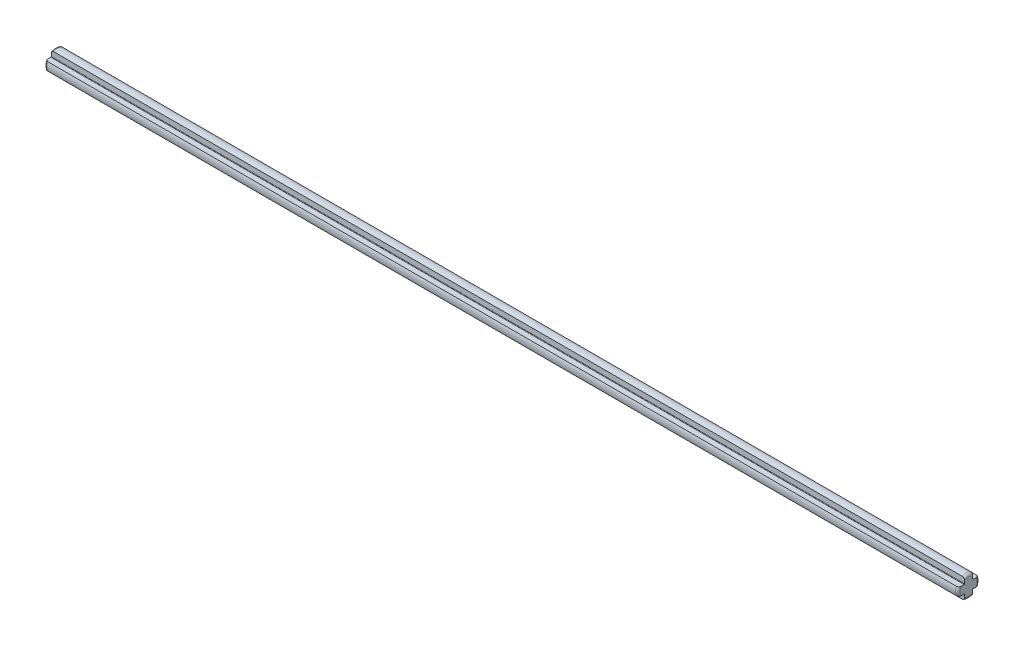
ISO-10303-21;
HEADER;
FILE_DESCRIPTION(('STEP AP214'),'2;1');
FILE_NAME('part.step','',(''),(''),'','','');
FILE_SCHEMA(('AUTOMOTIVE_DESIGN { 1 0 10303 214 1 1 1 1 }'));
ENDSEC;
DATA;
#1=APPLICATION_CONTEXT('core data for automotive mechanical design processes');
#2=APPLICATION_PROTOCOL_DEFINITION('international standard','automotive_design',2000,#1);
#3=PRODUCT_CONTEXT('',#1,'mechanical');
#4=PRODUCT('Part','Part','',(#3));
#5=PRODUCT_RELATED_PRODUCT_CATEGORY('part','',(#4));
#6=PRODUCT_DEFINITION_FORMATION('','',#4);
#7=PRODUCT_DEFINITION_CONTEXT('part definition',#1,'design');
#8=PRODUCT_DEFINITION('design','',#6,#7);
#9=PRODUCT_DEFINITION_SHAPE('','',#8);
#10=(LENGTH_UNIT() NAMED_UNIT(*) SI_UNIT(.MILLI.,.METRE.));
#11=(NAMED_UNIT(*) PLANE_ANGLE_UNIT() SI_UNIT($,.RADIAN.));
#12=(NAMED_UNIT(*) SI_UNIT($,.STERADIAN.) SOLID_ANGLE_UNIT());
#13=UNCERTAINTY_MEASURE_WITH_UNIT(LENGTH_MEASURE(1.E-05),#10,'distance_accuracy_value','');
#14=(GEOMETRIC_REPRESENTATION_CONTEXT(3) GLOBAL_UNCERTAINTY_ASSIGNED_CONTEXT((#13)) GLOBAL_UNIT_ASSIGNED_CONTEXT((#10,
#11,#12)) REPRESENTATION_CONTEXT('',''));
#15=CARTESIAN_POINT('',(0.,0.,0.));
#16=DIRECTION('',(0.,0.,1.));
#17=DIRECTION('',(1.,0.,0.));
#18=AXIS2_PLACEMENT_3D('',#15,#16,#17);
#19=CARTESIAN_POINT('',(100.,0.,0.));
#20=DIRECTION('',(-1.,0.,0.));
#21=DIRECTION('',(0.,0.,1.));
#22=AXIS2_PLACEMENT_3D('',#19,#20,#21);
#23=CYLINDRICAL_SURFACE('',#22,2.35);
#24=DIRECTION('',(-1.,0.,0.));
#25=VECTOR('',#24,1.);
#26=CARTESIAN_POINT('',(100.,0.9,2.17082933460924));
#27=LINE('',#26,#25);
#28=CARTESIAN_POINT('',(99.5,0.9,2.17082933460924));
#29=VERTEX_POINT('',#28);
#30=CARTESIAN_POINT('',(-99.5,0.9,2.17082933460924));
#31=VERTEX_POINT('',#30);
#32=EDGE_CURVE('E246',#29,#31,#27,.T.);
#33=ORIENTED_EDGE('',*,*,#32,.T.);
#34=CARTESIAN_POINT('',(-99.5,0.,0.));
#35=DIRECTION('',(1.,0.,0.));
#36=DIRECTION('',(0.,0.,-1.));
#37=AXIS2_PLACEMENT_3D('',#34,#35,#36);
#38=CIRCLE('',#37,2.35);
#39=CARTESIAN_POINT('',(-99.5,-0.900000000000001,2.17082933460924));
#40=VERTEX_POINT('',#39);
#41=EDGE_CURVE('E511',#31,#40,#38,.T.);
#42=ORIENTED_EDGE('',*,*,#41,.T.);
#43=DIRECTION('',(-1.,0.,0.));
#44=VECTOR('',#43,1.);
#45=CARTESIAN_POINT('',(100.,-0.900000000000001,2.17082933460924));
#46=LINE('',#45,#44);
#47=CARTESIAN_POINT('',(99.5,-0.900000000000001,2.17082933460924));
#48=VERTEX_POINT('',#47);
#49=EDGE_CURVE('E217',#48,#40,#46,.T.);
#50=ORIENTED_EDGE('',*,*,#49,.F.);
#51=CARTESIAN_POINT('',(99.5,0.,0.));
#52=DIRECTION('',(1.,0.,0.));
#53=DIRECTION('',(0.,0.,-1.));
#54=AXIS2_PLACEMENT_3D('',#51,#52,#53);
#55=CIRCLE('',#54,2.35);
#56=EDGE_CURVE('E366',#48,#29,#55,.F.);
#57=ORIENTED_EDGE('',*,*,#56,.T.);
#58=EDGE_LOOP('',(#33,#42,#50,#57));
#59=FACE_BOUND('',#58,.T.);
#60=ADVANCED_FACE('F33',(#59),#23,.T.);
#61=CARTESIAN_POINT('',(100.,-0.900000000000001,2.17082933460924));
#62=DIRECTION('',(0.,1.,0.));
#63=DIRECTION('',(0.,0.,1.));
#64=AXIS2_PLACEMENT_3D('',#61,#62,#63);
#65=PLANE('',#64);
#66=ORIENTED_EDGE('',*,*,#49,.T.);
#67=CARTESIAN_POINT('',(-99.5,-0.900000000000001,2.17082933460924));
#68=CARTESIAN_POINT('',(-99.5264833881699,-0.900000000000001,2.17085986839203));
#69=CARTESIAN_POINT('',(-99.5529498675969,-0.900000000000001,2.16855372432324));
#70=CARTESIAN_POINT('',(-99.6050453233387,-0.900000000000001,2.15950506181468));
#71=CARTESIAN_POINT('',(-99.6306762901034,-0.900000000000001,2.15277404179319));
#72=CARTESIAN_POINT('',(-99.6804387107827,-0.900000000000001,2.1351114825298));
#73=CARTESIAN_POINT('',(-99.7045703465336,-0.900000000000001,2.12418045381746));
#74=CARTESIAN_POINT('',(-99.7507251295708,-0.900000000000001,2.09852306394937));
#75=CARTESIAN_POINT('',(-99.7727475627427,-0.900000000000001,2.0837954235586));
#76=CARTESIAN_POINT('',(-99.8147234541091,-0.900000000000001,2.05060839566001));
#77=CARTESIAN_POINT('',(-99.8346070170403,-0.900000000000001,2.03206082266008));
#78=CARTESIAN_POINT('',(-99.8712243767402,-0.900000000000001,1.99209288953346));
#79=CARTESIAN_POINT('',(-99.8879579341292,-0.900000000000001,1.97067231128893));
#80=CARTESIAN_POINT('',(-99.9190973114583,-0.900000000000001,1.92396602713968));
#81=CARTESIAN_POINT('',(-99.9332527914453,-0.900000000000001,1.89851375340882));
#82=CARTESIAN_POINT('',(-99.9575247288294,-0.900000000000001,1.84573102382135));
#83=CARTESIAN_POINT('',(-99.9676367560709,-0.900000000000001,1.81839854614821));
#84=CARTESIAN_POINT('',(-99.9838866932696,-0.900000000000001,1.76219756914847));
#85=CARTESIAN_POINT('',(-99.9899702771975,-0.900000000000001,1.73331353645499));
#86=CARTESIAN_POINT('',(-99.9980270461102,-0.900000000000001,1.67505065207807));
#87=CARTESIAN_POINT('',(-100.000010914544,-0.900000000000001,1.64567328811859));
#88=CARTESIAN_POINT('',(-100.,-0.900000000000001,1.61632298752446));
#89=B_SPLINE_CURVE_WITH_KNOTS('',3,(#67,#68,#69,#70,#71,#72,#73,#74,#75,#76,#77,#78,#79,#80,#81,
#82,#83,#84,#85,#86,#87,#88),.UNSPECIFIED.,.F.,.F.,(4,2,2,2,2,2,2,2,2,2,4),(0.,
0.079323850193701,0.158442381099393,0.237551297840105,0.316686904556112,0.397909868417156,
0.479139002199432,0.566147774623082,0.653251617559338,0.741507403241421,0.829532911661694),.UNSPECIFIED.);
#90=CARTESIAN_POINT('',(-100.,-0.900000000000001,1.61632298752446));
#91=VERTEX_POINT('',#90);
#92=EDGE_CURVE('E386',#40,#91,#89,.T.);
#93=ORIENTED_EDGE('',*,*,#92,.T.);
#94=DIRECTION('',(0.,0.,-1.));
#95=VECTOR('',#94,1.);
#96=CARTESIAN_POINT('',(-100.,-0.900000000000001,2.17082933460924));
#97=LINE('',#96,#95);
#98=CARTESIAN_POINT('',(-100.,-0.900000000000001,0.999999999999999));
#99=VERTEX_POINT('',#98);
#100=EDGE_CURVE('E214',#91,#99,#97,.T.);
#101=ORIENTED_EDGE('',*,*,#100,.T.);
#102=DIRECTION('',(-1.,0.,0.));
#103=VECTOR('',#102,1.);
#104=CARTESIAN_POINT('',(100.,-0.900000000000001,0.999999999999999));
#105=LINE('',#104,#103);
#106=CARTESIAN_POINT('',(100.,-0.900000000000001,0.999999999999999));
#107=VERTEX_POINT('',#106);
#108=EDGE_CURVE('E210',#107,#99,#105,.T.);
#109=ORIENTED_EDGE('',*,*,#108,.F.);
#110=DIRECTION('',(0.,0.,-1.));
#111=VECTOR('',#110,1.);
#112=CARTESIAN_POINT('',(100.,-0.900000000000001,2.17082933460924));
#113=LINE('',#112,#111);
#114=CARTESIAN_POINT('',(100.,-0.900000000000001,1.61632298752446));
#115=VERTEX_POINT('',#114);
#116=EDGE_CURVE('E197',#115,#107,#113,.T.);
#117=ORIENTED_EDGE('',*,*,#116,.F.);
#118=CARTESIAN_POINT('',(100.,-0.900000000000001,1.61632298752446));
#119=CARTESIAN_POINT('',(100.000022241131,-0.900000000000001,1.65066661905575));
#120=CARTESIAN_POINT('',(99.9972983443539,-0.900000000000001,1.68506058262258));
#121=CARTESIAN_POINT('',(99.9862156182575,-0.900000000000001,1.75308687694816));
#122=CARTESIAN_POINT('',(99.9778303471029,-0.900000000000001,1.78671486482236));
#123=CARTESIAN_POINT('',(99.9552419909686,-0.900000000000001,1.85211366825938));
#124=CARTESIAN_POINT('',(99.9410195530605,-0.900000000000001,1.88387790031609));
#125=CARTESIAN_POINT('',(99.9069131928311,-0.900000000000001,1.94414749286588));
#126=CARTESIAN_POINT('',(99.8870416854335,-0.900000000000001,1.97265980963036));
#127=CARTESIAN_POINT('',(99.8442224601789,-0.900000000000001,2.02268935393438));
#128=CARTESIAN_POINT('',(99.8217526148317,-0.900000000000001,2.04461521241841));
#129=CARTESIAN_POINT('',(99.7730890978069,-0.900000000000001,2.08389547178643));
#130=CARTESIAN_POINT('',(99.7468952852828,-0.900000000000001,2.10124969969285));
#131=CARTESIAN_POINT('',(99.6943438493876,-0.900000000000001,2.12912089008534));
#132=CARTESIAN_POINT('',(99.6682509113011,-0.900000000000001,2.14013932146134));
#133=CARTESIAN_POINT('',(99.6145341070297,-0.900000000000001,2.15730052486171));
#134=CARTESIAN_POINT('',(99.586913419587,-0.900000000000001,2.1634530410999));
#135=CARTESIAN_POINT('',(99.5492135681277,-0.900000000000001,2.16830749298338));
#136=CARTESIAN_POINT('',(99.5393866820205,-0.900000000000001,2.1692533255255));
#137=CARTESIAN_POINT('',(99.5197081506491,-0.900000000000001,2.17051341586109));
#138=CARTESIAN_POINT('',(99.5098565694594,-0.900000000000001,2.17082867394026));
#139=CARTESIAN_POINT('',(99.5,-0.900000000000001,2.17082933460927));
#140=B_SPLINE_CURVE_WITH_KNOTS('',3,(#118,#119,#120,#121,#122,#123,#124,#125,#126,#127,#128,
#129,#130,#131,#132,#133,#134,#135,#136,#137,#138,#139),.UNSPECIFIED.,.F.,.F.,(4,2,2,2,2,2,2,2,
2,2,4),(0.,0.10300027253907,0.206484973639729,0.310315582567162,0.413919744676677,
0.507586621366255,0.601257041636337,0.68579977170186,0.770172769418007,0.799774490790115,
0.829329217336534),.UNSPECIFIED.);
#141=EDGE_CURVE('E516',#115,#48,#140,.T.);
#142=ORIENTED_EDGE('',*,*,#141,.T.);
#143=EDGE_LOOP('',(#66,#93,#101,#109,#117,#142));
#144=FACE_BOUND('',#143,.T.);
#145=ADVANCED_FACE('F212',(#144),#65,.F.);
#146=CARTESIAN_POINT('',(100.,-1.,0.999999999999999));
#147=DIRECTION('',(-1.,0.,0.));
#148=DIRECTION('',(0.,0.,1.));
#149=AXIS2_PLACEMENT_3D('',#146,#147,#148);
#150=CYLINDRICAL_SURFACE('',#149,0.0999999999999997);
#151=CARTESIAN_POINT('',(-100.,-1.,0.999999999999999));
#152=DIRECTION('',(-1.,0.,0.));
#153=DIRECTION('',(0.,0.,1.));
#154=AXIS2_PLACEMENT_3D('',#151,#152,#153);
#155=CIRCLE('',#154,0.0999999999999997);
#156=CARTESIAN_POINT('',(-100.,-1.,0.899999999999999));
#157=VERTEX_POINT('',#156);
#158=EDGE_CURVE('E248',#99,#157,#155,.T.);
#159=ORIENTED_EDGE('',*,*,#158,.T.);
#160=DIRECTION('',(-1.,0.,0.));
#161=VECTOR('',#160,1.);
#162=CARTESIAN_POINT('',(100.,-1.,0.899999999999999));
#163=LINE('',#162,#161);
#164=CARTESIAN_POINT('',(100.,-1.,0.899999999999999));
#165=VERTEX_POINT('',#164);
#166=EDGE_CURVE('E218',#165,#157,#163,.T.);
#167=ORIENTED_EDGE('',*,*,#166,.F.);
#168=CARTESIAN_POINT('',(100.,-1.,0.999999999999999));
#169=DIRECTION('',(-1.,0.,0.));
#170=DIRECTION('',(0.,0.,1.));
#171=AXIS2_PLACEMENT_3D('',#168,#169,#170);
#172=CIRCLE('',#171,0.0999999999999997);
#173=EDGE_CURVE('E203',#107,#165,#172,.T.);
#174=ORIENTED_EDGE('',*,*,#173,.F.);
#175=ORIENTED_EDGE('',*,*,#108,.T.);
#176=EDGE_LOOP('',(#159,#167,#174,#175));
#177=FACE_BOUND('',#176,.T.);
#178=ADVANCED_FACE('F220',(#177),#150,.F.);
#179=CARTESIAN_POINT('',(100.,-2.17082933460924,0.899999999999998));
#180=DIRECTION('',(0.,0.,-1.));
#181=DIRECTION('',(0.,1.,0.));
#182=AXIS2_PLACEMENT_3D('',#179,#180,#181);
#183=PLANE('',#182);
#184=DIRECTION('',(0.,-1.,0.));
#185=VECTOR('',#184,1.);
#186=CARTESIAN_POINT('',(-100.,-2.17082933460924,0.899999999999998));
#187=LINE('',#186,#185);
#188=CARTESIAN_POINT('',(-100.,-1.61632298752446,0.899999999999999));
#189=VERTEX_POINT('',#188);
#190=EDGE_CURVE('E250',#157,#189,#187,.T.);
#191=ORIENTED_EDGE('',*,*,#190,.T.);
#192=CARTESIAN_POINT('',(-100.,-1.61632298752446,0.899999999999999));
#193=CARTESIAN_POINT('',(-100.000022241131,-1.65066661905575,0.899999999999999));
#194=CARTESIAN_POINT('',(-99.9972983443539,-1.68506058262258,0.899999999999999));
#195=CARTESIAN_POINT('',(-99.9862156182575,-1.75308687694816,0.899999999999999));
#196=CARTESIAN_POINT('',(-99.9778303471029,-1.78671486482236,0.899999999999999));
#197=CARTESIAN_POINT('',(-99.9552419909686,-1.85211366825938,0.899999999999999));
#198=CARTESIAN_POINT('',(-99.9410195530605,-1.88387790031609,0.899999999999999));
#199=CARTESIAN_POINT('',(-99.9069131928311,-1.94414749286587,0.899999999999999));
#200=CARTESIAN_POINT('',(-99.8870416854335,-1.97265980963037,0.899999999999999));
#201=CARTESIAN_POINT('',(-99.844222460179,-2.02268935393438,0.899999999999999));
#202=CARTESIAN_POINT('',(-99.8217526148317,-2.0446152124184,0.899999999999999));
#203=CARTESIAN_POINT('',(-99.7730890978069,-2.08389547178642,0.899999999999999));
#204=CARTESIAN_POINT('',(-99.7468952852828,-2.10124969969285,0.899999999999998));
#205=CARTESIAN_POINT('',(-99.6943438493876,-2.12912089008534,0.899999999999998));
#206=CARTESIAN_POINT('',(-99.6682509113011,-2.14013932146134,0.899999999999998));
#207=CARTESIAN_POINT('',(-99.6145341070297,-2.15730052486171,0.899999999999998));
#208=CARTESIAN_POINT('',(-99.586913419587,-2.1634530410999,0.899999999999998));
#209=CARTESIAN_POINT('',(-99.5492135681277,-2.16830749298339,0.899999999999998));
#210=CARTESIAN_POINT('',(-99.5393866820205,-2.16925332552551,0.899999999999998));
#211=CARTESIAN_POINT('',(-99.5197081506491,-2.17051341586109,0.899999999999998));
#212=CARTESIAN_POINT('',(-99.5098565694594,-2.17082867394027,0.899999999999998));
#213=CARTESIAN_POINT('',(-99.5,-2.17082933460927,0.899999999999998));
#214=B_SPLINE_CURVE_WITH_KNOTS('',3,(#192,#193,#194,#195,#196,#197,#198,#199,#200,#201,#202,
#203,#204,#205,#206,#207,#208,#209,#210,#211,#212,#213),.UNSPECIFIED.,.F.,.F.,(4,2,2,2,2,2,2,2,
2,2,4),(0.,0.103000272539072,0.206484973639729,0.310315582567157,0.413919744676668,
0.507586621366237,0.601257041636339,0.685799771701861,0.770172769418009,0.79977449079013,
0.829329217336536),.UNSPECIFIED.);
#215=CARTESIAN_POINT('',(-99.5,-2.17082933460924,0.899999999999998));
#216=VERTEX_POINT('',#215);
#217=EDGE_CURVE('E361',#189,#216,#214,.T.);
#218=ORIENTED_EDGE('',*,*,#217,.T.);
#219=DIRECTION('',(-1.,0.,0.));
#220=VECTOR('',#219,1.);
#221=CARTESIAN_POINT('',(100.,-2.17082933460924,0.899999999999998));
#222=LINE('',#221,#220);
#223=CARTESIAN_POINT('',(99.5,-2.17082933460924,0.899999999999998));
#224=VERTEX_POINT('',#223);
#225=EDGE_CURVE('E308',#224,#216,#222,.T.);
#226=ORIENTED_EDGE('',*,*,#225,.F.);
#227=CARTESIAN_POINT('',(99.5,-2.17082933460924,0.899999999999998));
#228=CARTESIAN_POINT('',(99.5264833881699,-2.17085986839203,0.899999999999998));
#229=CARTESIAN_POINT('',(99.5529498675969,-2.16855372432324,0.899999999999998));
#230=CARTESIAN_POINT('',(99.6050453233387,-2.15950506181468,0.899999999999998));
#231=CARTESIAN_POINT('',(99.6306762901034,-2.15277404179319,0.899999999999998));
#232=CARTESIAN_POINT('',(99.6804387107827,-2.1351114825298,0.899999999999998));
#233=CARTESIAN_POINT('',(99.7045703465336,-2.12418045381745,0.899999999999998));
#234=CARTESIAN_POINT('',(99.7507251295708,-2.09852306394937,0.899999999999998));
#235=CARTESIAN_POINT('',(99.7727475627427,-2.0837954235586,0.899999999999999));
#236=CARTESIAN_POINT('',(99.8147234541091,-2.05060839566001,0.899999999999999));
#237=CARTESIAN_POINT('',(99.8346070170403,-2.03206082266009,0.899999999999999));
#238=CARTESIAN_POINT('',(99.8712243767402,-1.99209288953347,0.899999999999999));
#239=CARTESIAN_POINT('',(99.8879579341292,-1.97067231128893,0.899999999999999));
#240=CARTESIAN_POINT('',(99.9190973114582,-1.92396602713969,0.899999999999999));
#241=CARTESIAN_POINT('',(99.9332527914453,-1.89851375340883,0.899999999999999));
#242=CARTESIAN_POINT('',(99.9575247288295,-1.84573102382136,0.899999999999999));
#243=CARTESIAN_POINT('',(99.9676367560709,-1.81839854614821,0.899999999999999));
#244=CARTESIAN_POINT('',(99.9838866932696,-1.76219756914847,0.899999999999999));
#245=CARTESIAN_POINT('',(99.9899702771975,-1.73331353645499,0.899999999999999));
#246=CARTESIAN_POINT('',(99.9980270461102,-1.67505065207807,0.899999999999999));
#247=CARTESIAN_POINT('',(100.000010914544,-1.6456732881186,0.899999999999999));
#248=CARTESIAN_POINT('',(100.,-1.61632298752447,0.899999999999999));
#249=B_SPLINE_CURVE_WITH_KNOTS('',3,(#227,#228,#229,#230,#231,#232,#233,#234,#235,#236,#237,
#238,#239,#240,#241,#242,#243,#244,#245,#246,#247,#248),.UNSPECIFIED.,.F.,.F.,(4,2,2,2,2,2,2,2,
2,2,4),(0.,0.079323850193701,0.158442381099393,0.237551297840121,0.316686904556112,
0.397909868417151,0.47913900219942,0.566147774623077,0.653251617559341,0.741507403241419,
0.829532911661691),.UNSPECIFIED.);
#250=CARTESIAN_POINT('',(100.,-1.61632298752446,0.899999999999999));
#251=VERTEX_POINT('',#250);
#252=EDGE_CURVE('E355',#224,#251,#249,.T.);
#253=ORIENTED_EDGE('',*,*,#252,.T.);
#254=DIRECTION('',(0.,-1.,0.));
#255=VECTOR('',#254,1.);
#256=CARTESIAN_POINT('',(100.,-2.17082933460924,0.899999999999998));
#257=LINE('',#256,#255);
#258=EDGE_CURVE('E223',#165,#251,#257,.T.);
#259=ORIENTED_EDGE('',*,*,#258,.F.);
#260=ORIENTED_EDGE('',*,*,#166,.T.);
#261=EDGE_LOOP('',(#191,#218,#226,#253,#259,#260));
#262=FACE_BOUND('',#261,.T.);
#263=ADVANCED_FACE('F346',(#262),#183,.F.);
#264=CARTESIAN_POINT('',(100.,0.,0.));
#265=DIRECTION('',(-1.,0.,0.));
#266=DIRECTION('',(0.,0.,1.));
#267=AXIS2_PLACEMENT_3D('',#264,#265,#266);
#268=CYLINDRICAL_SURFACE('',#267,2.35);
#269=ORIENTED_EDGE('',*,*,#225,.T.);
#270=CARTESIAN_POINT('',(-99.5,0.,0.));
#271=DIRECTION('',(1.,0.,0.));
#272=DIRECTION('',(0.,0.,-1.));
#273=AXIS2_PLACEMENT_3D('',#270,#271,#272);
#274=CIRCLE('',#273,2.35);
#275=CARTESIAN_POINT('',(-99.5,-2.17082933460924,-0.9));
#276=VERTEX_POINT('',#275);
#277=EDGE_CURVE('E315',#216,#276,#274,.T.);
#278=ORIENTED_EDGE('',*,*,#277,.T.);
#279=DIRECTION('',(-1.,0.,0.));
#280=VECTOR('',#279,1.);
#281=CARTESIAN_POINT('',(100.,-2.17082933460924,-0.9));
#282=LINE('',#281,#280);
#283=CARTESIAN_POINT('',(99.5,-2.17082933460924,-0.9));
#284=VERTEX_POINT('',#283);
#285=EDGE_CURVE('E305',#284,#276,#282,.T.);
#286=ORIENTED_EDGE('',*,*,#285,.F.);
#287=CARTESIAN_POINT('',(99.5,0.,0.));
#288=DIRECTION('',(1.,0.,0.));
#289=DIRECTION('',(0.,0.,-1.));
#290=AXIS2_PLACEMENT_3D('',#287,#288,#289);
#291=CIRCLE('',#290,2.35);
#292=EDGE_CURVE('E313',#284,#224,#291,.F.);
#293=ORIENTED_EDGE('',*,*,#292,.T.);
#294=EDGE_LOOP('',(#269,#278,#286,#293));
#295=FACE_BOUND('',#294,.T.);
#296=ADVANCED_FACE('F340',(#295),#268,.T.);
#297=CARTESIAN_POINT('',(100.,-2.17082933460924,-0.9));
#298=DIRECTION('',(0.,0.,1.));
#299=DIRECTION('',(0.,-1.,0.));
#300=AXIS2_PLACEMENT_3D('',#297,#298,#299);
#301=PLANE('',#300);
#302=ORIENTED_EDGE('',*,*,#285,.T.);
#303=CARTESIAN_POINT('',(-99.5,-2.17082933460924,-0.9));
#304=CARTESIAN_POINT('',(-99.5264833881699,-2.17085986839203,-0.9));
#305=CARTESIAN_POINT('',(-99.5529498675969,-2.16855372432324,-0.9));
#306=CARTESIAN_POINT('',(-99.6050453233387,-2.15950506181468,-0.9));
#307=CARTESIAN_POINT('',(-99.6306762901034,-2.15277404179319,-0.9));
#308=CARTESIAN_POINT('',(-99.6804387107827,-2.1351114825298,-0.9));
#309=CARTESIAN_POINT('',(-99.7045703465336,-2.12418045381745,-0.9));
#310=CARTESIAN_POINT('',(-99.7507251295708,-2.09852306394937,-0.9));
#311=CARTESIAN_POINT('',(-99.7727475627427,-2.0837954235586,-0.9));
#312=CARTESIAN_POINT('',(-99.8147234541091,-2.05060839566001,-0.9));
#313=CARTESIAN_POINT('',(-99.8346070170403,-2.03206082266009,-0.9));
#314=CARTESIAN_POINT('',(-99.8712243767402,-1.99209288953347,-0.9));
#315=CARTESIAN_POINT('',(-99.8879579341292,-1.97067231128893,-0.9));
#316=CARTESIAN_POINT('',(-99.9190973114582,-1.92396602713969,-0.9));
#317=CARTESIAN_POINT('',(-99.9332527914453,-1.89851375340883,-0.9));
#318=CARTESIAN_POINT('',(-99.9575247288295,-1.84573102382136,-0.9));
#319=CARTESIAN_POINT('',(-99.9676367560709,-1.81839854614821,-0.9));
#320=CARTESIAN_POINT('',(-99.9838866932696,-1.76219756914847,-0.9));
#321=CARTESIAN_POINT('',(-99.9899702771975,-1.73331353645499,-0.9));
#322=CARTESIAN_POINT('',(-99.9980270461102,-1.67505065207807,-0.9));
#323=CARTESIAN_POINT('',(-100.000010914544,-1.64567328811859,-0.9));
#324=CARTESIAN_POINT('',(-100.,-1.61632298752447,-0.9));
#325=B_SPLINE_CURVE_WITH_KNOTS('',3,(#303,#304,#305,#306,#307,#308,#309,#310,#311,#312,#313,
#314,#315,#316,#317,#318,#319,#320,#321,#322,#323,#324),.UNSPECIFIED.,.F.,.F.,(4,2,2,2,2,2,2,2,
2,2,4),(0.,0.079323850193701,0.158442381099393,0.237551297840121,0.316686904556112,
0.397909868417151,0.47913900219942,0.566147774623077,0.653251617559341,0.741507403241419,
0.829532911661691),.UNSPECIFIED.);
#326=CARTESIAN_POINT('',(-100.,-1.61632298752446,-0.9));
#327=VERTEX_POINT('',#326);
#328=EDGE_CURVE('E325',#276,#327,#325,.T.);
#329=ORIENTED_EDGE('',*,*,#328,.T.);
#330=DIRECTION('',(0.,1.,0.));
#331=VECTOR('',#330,1.);
#332=CARTESIAN_POINT('',(-100.,-2.17082933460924,-0.9));
#333=LINE('',#332,#331);
#334=CARTESIAN_POINT('',(-100.,-1.,-0.9));
#335=VERTEX_POINT('',#334);
#336=EDGE_CURVE('E253',#327,#335,#333,.T.);
#337=ORIENTED_EDGE('',*,*,#336,.T.);
#338=DIRECTION('',(-1.,0.,0.));
#339=VECTOR('',#338,1.);
#340=CARTESIAN_POINT('',(100.,-1.,-0.9));
#341=LINE('',#340,#339);
#342=CARTESIAN_POINT('',(100.,-1.,-0.9));
#343=VERTEX_POINT('',#342);
#344=EDGE_CURVE('E302',#343,#335,#341,.T.);
#345=ORIENTED_EDGE('',*,*,#344,.F.);
#346=DIRECTION('',(0.,1.,0.));
#347=VECTOR('',#346,1.);
#348=CARTESIAN_POINT('',(100.,-2.17082933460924,-0.9));
#349=LINE('',#348,#347);
#350=CARTESIAN_POINT('',(100.,-1.61632298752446,-0.9));
#351=VERTEX_POINT('',#350);
#352=EDGE_CURVE('E225',#351,#343,#349,.T.);
#353=ORIENTED_EDGE('',*,*,#352,.F.);
#354=CARTESIAN_POINT('',(100.,-1.61632298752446,-0.9));
#355=CARTESIAN_POINT('',(100.000022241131,-1.65066661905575,-0.9));
#356=CARTESIAN_POINT('',(99.9972983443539,-1.68506058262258,-0.9));
#357=CARTESIAN_POINT('',(99.9862156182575,-1.75308687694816,-0.9));
#358=CARTESIAN_POINT('',(99.9778303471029,-1.78671486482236,-0.9));
#359=CARTESIAN_POINT('',(99.9552419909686,-1.85211366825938,-0.9));
#360=CARTESIAN_POINT('',(99.9410195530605,-1.88387790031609,-0.9));
#361=CARTESIAN_POINT('',(99.9069131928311,-1.94414749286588,-0.9));
#362=CARTESIAN_POINT('',(99.8870416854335,-1.97265980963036,-0.9));
#363=CARTESIAN_POINT('',(99.844222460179,-2.02268935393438,-0.9));
#364=CARTESIAN_POINT('',(99.8217526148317,-2.04461521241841,-0.9));
#365=CARTESIAN_POINT('',(99.7730890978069,-2.08389547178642,-0.9));
#366=CARTESIAN_POINT('',(99.7468952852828,-2.10124969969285,-0.9));
#367=CARTESIAN_POINT('',(99.6943438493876,-2.12912089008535,-0.9));
#368=CARTESIAN_POINT('',(99.6682509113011,-2.14013932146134,-0.9));
#369=CARTESIAN_POINT('',(99.6145341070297,-2.15730052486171,-0.9));
#370=CARTESIAN_POINT('',(99.586913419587,-2.1634530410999,-0.9));
#371=CARTESIAN_POINT('',(99.5492135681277,-2.16830749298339,-0.9));
#372=CARTESIAN_POINT('',(99.5393866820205,-2.16925332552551,-0.9));
#373=CARTESIAN_POINT('',(99.5197081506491,-2.17051341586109,-0.9));
#374=CARTESIAN_POINT('',(99.5098565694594,-2.17082867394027,-0.9));
#375=CARTESIAN_POINT('',(99.5,-2.17082933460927,-0.9));
#376=B_SPLINE_CURVE_WITH_KNOTS('',3,(#354,#355,#356,#357,#358,#359,#360,#361,#362,#363,#364,
#365,#366,#367,#368,#369,#370,#371,#372,#373,#374,#375),.UNSPECIFIED.,.F.,.F.,(4,2,2,2,2,2,2,2,
2,2,4),(0.,0.103000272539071,0.206484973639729,0.310315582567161,0.413919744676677,
0.50758662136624,0.601257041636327,0.685799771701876,0.770172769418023,0.799774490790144,
0.829329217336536),.UNSPECIFIED.);
#377=EDGE_CURVE('E318',#351,#284,#376,.T.);
#378=ORIENTED_EDGE('',*,*,#377,.T.);
#379=EDGE_LOOP('',(#302,#329,#337,#345,#353,#378));
#380=FACE_BOUND('',#379,.T.);
#381=ADVANCED_FACE('F334',(#380),#301,.F.);
#382=CARTESIAN_POINT('',(100.,-1.,-1.));
#383=DIRECTION('',(-1.,0.,0.));
#384=DIRECTION('',(0.,0.,1.));
#385=AXIS2_PLACEMENT_3D('',#382,#383,#384);
#386=CYLINDRICAL_SURFACE('',#385,0.0999999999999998);
#387=CARTESIAN_POINT('',(-100.,-1.,-1.));
#388=DIRECTION('',(-1.,0.,0.));
#389=DIRECTION('',(0.,0.,-1.));
#390=AXIS2_PLACEMENT_3D('',#387,#388,#389);
#391=CIRCLE('',#390,0.0999999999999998);
#392=CARTESIAN_POINT('',(-100.,-0.9,-1.));
#393=VERTEX_POINT('',#392);
#394=EDGE_CURVE('E255',#335,#393,#391,.T.);
#395=ORIENTED_EDGE('',*,*,#394,.T.);
#396=DIRECTION('',(-1.,0.,0.));
#397=VECTOR('',#396,1.);
#398=CARTESIAN_POINT('',(100.,-0.9,-1.));
#399=LINE('',#398,#397);
#400=CARTESIAN_POINT('',(100.,-0.9,-1.));
#401=VERTEX_POINT('',#400);
#402=EDGE_CURVE('E299',#401,#393,#399,.T.);
#403=ORIENTED_EDGE('',*,*,#402,.F.);
#404=CARTESIAN_POINT('',(100.,-1.,-1.));
#405=DIRECTION('',(-1.,0.,0.));
#406=DIRECTION('',(0.,0.,-1.));
#407=AXIS2_PLACEMENT_3D('',#404,#405,#406);
#408=CIRCLE('',#407,0.0999999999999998);
#409=EDGE_CURVE('E229',#343,#401,#408,.T.);
#410=ORIENTED_EDGE('',*,*,#409,.F.);
#411=ORIENTED_EDGE('',*,*,#344,.T.);
#412=EDGE_LOOP('',(#395,#403,#410,#411));
#413=FACE_BOUND('',#412,.T.);
#414=ADVANCED_FACE('F339',(#413),#386,.F.);
#415=CARTESIAN_POINT('',(100.,-0.900000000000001,-2.17082933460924));
#416=DIRECTION('',(0.,1.,0.));
#417=DIRECTION('',(0.,0.,1.));
#418=AXIS2_PLACEMENT_3D('',#415,#416,#417);
#419=PLANE('',#418);
#420=DIRECTION('',(0.,0.,-1.));
#421=VECTOR('',#420,1.);
#422=CARTESIAN_POINT('',(-100.,-0.900000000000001,-2.17082933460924));
#423=LINE('',#422,#421);
#424=CARTESIAN_POINT('',(-100.,-0.9,-1.61632298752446));
#425=VERTEX_POINT('',#424);
#426=EDGE_CURVE('E257',#393,#425,#423,.T.);
#427=ORIENTED_EDGE('',*,*,#426,.T.);
#428=CARTESIAN_POINT('',(-100.,-0.9,-1.61632298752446));
#429=CARTESIAN_POINT('',(-100.000022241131,-0.9,-1.65066661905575));
#430=CARTESIAN_POINT('',(-99.9972983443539,-0.9,-1.68506058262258));
#431=CARTESIAN_POINT('',(-99.9862156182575,-0.9,-1.75308687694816));
#432=CARTESIAN_POINT('',(-99.9778303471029,-0.9,-1.78671486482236));
#433=CARTESIAN_POINT('',(-99.9552419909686,-0.9,-1.85211366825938));
#434=CARTESIAN_POINT('',(-99.9410195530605,-0.9,-1.88387790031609));
#435=CARTESIAN_POINT('',(-99.9069131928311,-0.9,-1.94414749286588));
#436=CARTESIAN_POINT('',(-99.8870416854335,-0.9,-1.97265980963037));
#437=CARTESIAN_POINT('',(-99.8442224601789,-0.9,-2.02268935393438));
#438=CARTESIAN_POINT('',(-99.8217526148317,-0.900000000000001,-2.04461521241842));
#439=CARTESIAN_POINT('',(-99.7730890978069,-0.900000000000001,-2.08389547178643));
#440=CARTESIAN_POINT('',(-99.7468952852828,-0.900000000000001,-2.10124969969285));
#441=CARTESIAN_POINT('',(-99.6943438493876,-0.900000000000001,-2.12912089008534));
#442=CARTESIAN_POINT('',(-99.6682509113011,-0.900000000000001,-2.14013932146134));
#443=CARTESIAN_POINT('',(-99.6145341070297,-0.900000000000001,-2.15730052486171));
#444=CARTESIAN_POINT('',(-99.586913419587,-0.900000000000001,-2.1634530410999));
#445=CARTESIAN_POINT('',(-99.5492135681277,-0.900000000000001,-2.16830749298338));
#446=CARTESIAN_POINT('',(-99.5393866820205,-0.900000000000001,-2.1692533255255));
#447=CARTESIAN_POINT('',(-99.5197081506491,-0.900000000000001,-2.17051341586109));
#448=CARTESIAN_POINT('',(-99.5098565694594,-0.900000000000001,-2.17082867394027));
#449=CARTESIAN_POINT('',(-99.5,-0.900000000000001,-2.17082933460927));
#450=B_SPLINE_CURVE_WITH_KNOTS('',3,(#428,#429,#430,#431,#432,#433,#434,#435,#436,#437,#438,
#439,#440,#441,#442,#443,#444,#445,#446,#447,#448,#449),.UNSPECIFIED.,.F.,.F.,(4,2,2,2,2,2,2,2,
2,2,4),(0.,0.103000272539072,0.206484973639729,0.310315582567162,0.413919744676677,
0.507586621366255,0.601257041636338,0.68579977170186,0.770172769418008,0.799774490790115,
0.829329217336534),.UNSPECIFIED.);
#451=CARTESIAN_POINT('',(-99.5,-0.9,-2.17082933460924));
#452=VERTEX_POINT('',#451);
#453=EDGE_CURVE('E485',#425,#452,#450,.T.);
#454=ORIENTED_EDGE('',*,*,#453,.T.);
#455=DIRECTION('',(-1.,0.,0.));
#456=VECTOR('',#455,1.);
#457=CARTESIAN_POINT('',(100.,-0.9,-2.17082933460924));
#458=LINE('',#457,#456);
#459=CARTESIAN_POINT('',(99.5,-0.9,-2.17082933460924));
#460=VERTEX_POINT('',#459);
#461=EDGE_CURVE('E296',#460,#452,#458,.T.);
#462=ORIENTED_EDGE('',*,*,#461,.F.);
#463=CARTESIAN_POINT('',(99.5,-0.9,-2.17082933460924));
#464=CARTESIAN_POINT('',(99.5264833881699,-0.9,-2.17085986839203));
#465=CARTESIAN_POINT('',(99.5529498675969,-0.900000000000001,-2.16855372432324));
#466=CARTESIAN_POINT('',(99.6050453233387,-0.900000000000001,-2.15950506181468));
#467=CARTESIAN_POINT('',(99.6306762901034,-0.900000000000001,-2.15277404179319));
#468=CARTESIAN_POINT('',(99.6804387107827,-0.900000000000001,-2.1351114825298));
#469=CARTESIAN_POINT('',(99.7045703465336,-0.900000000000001,-2.12418045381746));
#470=CARTESIAN_POINT('',(99.7507251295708,-0.900000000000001,-2.09852306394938));
#471=CARTESIAN_POINT('',(99.7727475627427,-0.900000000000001,-2.0837954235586));
#472=CARTESIAN_POINT('',(99.8147234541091,-0.900000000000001,-2.05060839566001));
#473=CARTESIAN_POINT('',(99.8346070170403,-0.9,-2.03206082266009));
#474=CARTESIAN_POINT('',(99.8712243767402,-0.9,-1.99209288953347));
#475=CARTESIAN_POINT('',(99.8879579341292,-0.9,-1.97067231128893));
#476=CARTESIAN_POINT('',(99.9190973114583,-0.9,-1.92396602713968));
#477=CARTESIAN_POINT('',(99.9332527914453,-0.9,-1.89851375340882));
#478=CARTESIAN_POINT('',(99.9575247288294,-0.9,-1.84573102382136));
#479=CARTESIAN_POINT('',(99.9676367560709,-0.9,-1.81839854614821));
#480=CARTESIAN_POINT('',(99.9838866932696,-0.9,-1.76219756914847));
#481=CARTESIAN_POINT('',(99.9899702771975,-0.9,-1.73331353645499));
#482=CARTESIAN_POINT('',(99.9980270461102,-0.9,-1.67505065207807));
#483=CARTESIAN_POINT('',(100.000010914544,-0.9,-1.64567328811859));
#484=CARTESIAN_POINT('',(100.,-0.9,-1.61632298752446));
#485=B_SPLINE_CURVE_WITH_KNOTS('',3,(#463,#464,#465,#466,#467,#468,#469,#470,#471,#472,#473,
#474,#475,#476,#477,#478,#479,#480,#481,#482,#483,#484),.UNSPECIFIED.,.F.,.F.,(4,2,2,2,2,2,2,2,
2,2,4),(0.,0.079323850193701,0.158442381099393,0.237551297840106,0.316686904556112,
0.397909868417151,0.479139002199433,0.566147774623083,0.653251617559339,0.741507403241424,
0.829532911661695),.UNSPECIFIED.);
#486=CARTESIAN_POINT('',(100.,-0.9,-1.61632298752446));
#487=VERTEX_POINT('',#486);
#488=EDGE_CURVE('E49',#460,#487,#485,.T.);
#489=ORIENTED_EDGE('',*,*,#488,.T.);
#490=DIRECTION('',(0.,0.,-1.));
#491=VECTOR('',#490,1.);
#492=CARTESIAN_POINT('',(100.,-0.900000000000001,-2.17082933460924));
#493=LINE('',#492,#491);
#494=EDGE_CURVE('E231',#401,#487,#493,.T.);
#495=ORIENTED_EDGE('',*,*,#494,.F.);
#496=ORIENTED_EDGE('',*,*,#402,.T.);
#497=EDGE_LOOP('',(#427,#454,#462,#489,#495,#496));
#498=FACE_BOUND('',#497,.T.);
#499=ADVANCED_FACE('F492',(#498),#419,.F.);
#500=CARTESIAN_POINT('',(100.,0.,0.));
#501=DIRECTION('',(-1.,0.,0.));
#502=DIRECTION('',(0.,0.,1.));
#503=AXIS2_PLACEMENT_3D('',#500,#501,#502);
#504=CYLINDRICAL_SURFACE('',#503,2.35);
#505=ORIENTED_EDGE('',*,*,#461,.T.);
#506=CARTESIAN_POINT('',(-99.5,0.,0.));
#507=DIRECTION('',(1.,0.,0.));
#508=DIRECTION('',(0.,0.,-1.));
#509=AXIS2_PLACEMENT_3D('',#506,#507,#508);
#510=CIRCLE('',#509,2.35);
#511=CARTESIAN_POINT('',(-99.5,0.900000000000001,-2.17082933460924));
#512=VERTEX_POINT('',#511);
#513=EDGE_CURVE('E571',#452,#512,#510,.T.);
#514=ORIENTED_EDGE('',*,*,#513,.T.);
#515=DIRECTION('',(-1.,0.,0.));
#516=VECTOR('',#515,1.);
#517=CARTESIAN_POINT('',(100.,0.900000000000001,-2.17082933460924));
#518=LINE('',#517,#516);
#519=CARTESIAN_POINT('',(99.5,0.900000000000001,-2.17082933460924));
#520=VERTEX_POINT('',#519);
#521=EDGE_CURVE('E293',#520,#512,#518,.T.);
#522=ORIENTED_EDGE('',*,*,#521,.F.);
#523=CARTESIAN_POINT('',(99.5,0.,0.));
#524=DIRECTION('',(1.,0.,0.));
#525=DIRECTION('',(0.,0.,-1.));
#526=AXIS2_PLACEMENT_3D('',#523,#524,#525);
#527=CIRCLE('',#526,2.35);
#528=EDGE_CURVE('E570',#520,#460,#527,.F.);
#529=ORIENTED_EDGE('',*,*,#528,.T.);
#530=EDGE_LOOP('',(#505,#514,#522,#529));
#531=FACE_BOUND('',#530,.T.);
#532=ADVANCED_FACE('F460',(#531),#504,.T.);
#533=CARTESIAN_POINT('',(100.,0.900000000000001,-2.17082933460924));
#534=DIRECTION('',(0.,-1.,0.));
#535=DIRECTION('',(0.,0.,-1.));
#536=AXIS2_PLACEMENT_3D('',#533,#534,#535);
#537=PLANE('',#536);
#538=ORIENTED_EDGE('',*,*,#521,.T.);
#539=CARTESIAN_POINT('',(-99.5,0.900000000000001,-2.17082933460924));
#540=CARTESIAN_POINT('',(-99.5264833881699,0.900000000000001,-2.17085986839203));
#541=CARTESIAN_POINT('',(-99.5529498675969,0.900000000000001,-2.16855372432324));
#542=CARTESIAN_POINT('',(-99.6050453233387,0.900000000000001,-2.15950506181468));
#543=CARTESIAN_POINT('',(-99.6306762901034,0.900000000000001,-2.15277404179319));
#544=CARTESIAN_POINT('',(-99.6804387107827,0.900000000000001,-2.1351114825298));
#545=CARTESIAN_POINT('',(-99.7045703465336,0.900000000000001,-2.12418045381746));
#546=CARTESIAN_POINT('',(-99.7507251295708,0.900000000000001,-2.09852306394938));
#547=CARTESIAN_POINT('',(-99.7727475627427,0.900000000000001,-2.0837954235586));
#548=CARTESIAN_POINT('',(-99.8147234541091,0.900000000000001,-2.05060839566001));
#549=CARTESIAN_POINT('',(-99.8346070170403,0.9,-2.03206082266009));
#550=CARTESIAN_POINT('',(-99.8712243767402,0.9,-1.99209288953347));
#551=CARTESIAN_POINT('',(-99.8879579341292,0.9,-1.97067231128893));
#552=CARTESIAN_POINT('',(-99.9190973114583,0.9,-1.92396602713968));
#553=CARTESIAN_POINT('',(-99.9332527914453,0.9,-1.89851375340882));
#554=CARTESIAN_POINT('',(-99.9575247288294,0.9,-1.84573102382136));
#555=CARTESIAN_POINT('',(-99.9676367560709,0.9,-1.81839854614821));
#556=CARTESIAN_POINT('',(-99.9838866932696,0.9,-1.76219756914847));
#557=CARTESIAN_POINT('',(-99.9899702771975,0.9,-1.73331353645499));
#558=CARTESIAN_POINT('',(-99.9980270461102,0.9,-1.67505065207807));
#559=CARTESIAN_POINT('',(-100.000010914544,0.9,-1.64567328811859));
#560=CARTESIAN_POINT('',(-100.,0.9,-1.61632298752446));
#561=B_SPLINE_CURVE_WITH_KNOTS('',3,(#539,#540,#541,#542,#543,#544,#545,#546,#547,#548,#549,
#550,#551,#552,#553,#554,#555,#556,#557,#558,#559,#560),.UNSPECIFIED.,.F.,.F.,(4,2,2,2,2,2,2,2,
2,2,4),(0.,0.079323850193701,0.158442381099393,0.237551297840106,0.316686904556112,
0.397909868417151,0.479139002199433,0.566147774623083,0.653251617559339,0.741507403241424,
0.829532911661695),.UNSPECIFIED.);
#562=CARTESIAN_POINT('',(-100.,0.9,-1.61632298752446));
#563=VERTEX_POINT('',#562);
#564=EDGE_CURVE('E469',#512,#563,#561,.T.);
#565=ORIENTED_EDGE('',*,*,#564,.T.);
#566=DIRECTION('',(0.,0.,1.));
#567=VECTOR('',#566,1.);
#568=CARTESIAN_POINT('',(-100.,0.900000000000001,-2.17082933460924));
#569=LINE('',#568,#567);
#570=CARTESIAN_POINT('',(-100.,0.9,-1.));
#571=VERTEX_POINT('',#570);
#572=EDGE_CURVE('E260',#563,#571,#569,.T.);
#573=ORIENTED_EDGE('',*,*,#572,.T.);
#574=DIRECTION('',(-1.,0.,0.));
#575=VECTOR('',#574,1.);
#576=CARTESIAN_POINT('',(100.,0.9,-1.));
#577=LINE('',#576,#575);
#578=CARTESIAN_POINT('',(100.,0.9,-1.));
#579=VERTEX_POINT('',#578);
#580=EDGE_CURVE('E290',#579,#571,#577,.T.);
#581=ORIENTED_EDGE('',*,*,#580,.F.);
#582=DIRECTION('',(0.,0.,1.));
#583=VECTOR('',#582,1.);
#584=CARTESIAN_POINT('',(100.,0.900000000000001,-2.17082933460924));
#585=LINE('',#584,#583);
#586=CARTESIAN_POINT('',(100.,0.9,-1.61632298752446));
#587=VERTEX_POINT('',#586);
#588=EDGE_CURVE('E233',#587,#579,#585,.T.);
#589=ORIENTED_EDGE('',*,*,#588,.F.);
#590=CARTESIAN_POINT('',(100.,0.9,-1.61632298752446));
#591=CARTESIAN_POINT('',(100.000022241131,0.9,-1.65066661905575));
#592=CARTESIAN_POINT('',(99.9972983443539,0.9,-1.68506058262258));
#593=CARTESIAN_POINT('',(99.9862156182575,0.9,-1.75308687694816));
#594=CARTESIAN_POINT('',(99.9778303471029,0.9,-1.78671486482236));
#595=CARTESIAN_POINT('',(99.9552419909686,0.9,-1.85211366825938));
#596=CARTESIAN_POINT('',(99.9410195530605,0.9,-1.88387790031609));
#597=CARTESIAN_POINT('',(99.9069131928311,0.9,-1.94414749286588));
#598=CARTESIAN_POINT('',(99.8870416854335,0.9,-1.97265980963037));
#599=CARTESIAN_POINT('',(99.8442224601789,0.9,-2.02268935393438));
#600=CARTESIAN_POINT('',(99.8217526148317,0.900000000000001,-2.04461521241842));
#601=CARTESIAN_POINT('',(99.7730890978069,0.900000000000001,-2.08389547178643));
#602=CARTESIAN_POINT('',(99.7468952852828,0.900000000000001,-2.10124969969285));
#603=CARTESIAN_POINT('',(99.6943438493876,0.900000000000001,-2.12912089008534));
#604=CARTESIAN_POINT('',(99.6682509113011,0.900000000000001,-2.14013932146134));
#605=CARTESIAN_POINT('',(99.6145341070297,0.900000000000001,-2.15730052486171));
#606=CARTESIAN_POINT('',(99.586913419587,0.900000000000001,-2.1634530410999));
#607=CARTESIAN_POINT('',(99.5492135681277,0.900000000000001,-2.16830749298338));
#608=CARTESIAN_POINT('',(99.5393866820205,0.900000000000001,-2.1692533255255));
#609=CARTESIAN_POINT('',(99.5197081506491,0.900000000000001,-2.17051341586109));
#610=CARTESIAN_POINT('',(99.5098565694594,0.900000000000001,-2.17082867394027));
#611=CARTESIAN_POINT('',(99.5,0.900000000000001,-2.17082933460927));
#612=B_SPLINE_CURVE_WITH_KNOTS('',3,(#590,#591,#592,#593,#594,#595,#596,#597,#598,#599,#600,
#601,#602,#603,#604,#605,#606,#607,#608,#609,#610,#611),.UNSPECIFIED.,.F.,.F.,(4,2,2,2,2,2,2,2,
2,2,4),(0.,0.103000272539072,0.206484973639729,0.310315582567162,0.413919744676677,
0.507586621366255,0.601257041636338,0.68579977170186,0.770172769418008,0.799774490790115,
0.829329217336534),.UNSPECIFIED.);
#613=EDGE_CURVE('E57',#587,#520,#612,.T.);
#614=ORIENTED_EDGE('',*,*,#613,.T.);
#615=EDGE_LOOP('',(#538,#565,#573,#581,#589,#614));
#616=FACE_BOUND('',#615,.T.);
#617=ADVANCED_FACE('F455',(#616),#537,.F.);
#618=CARTESIAN_POINT('',(100.,1.,-1.));
#619=DIRECTION('',(-1.,0.,0.));
#620=DIRECTION('',(0.,0.,1.));
#621=AXIS2_PLACEMENT_3D('',#618,#619,#620);
#622=CYLINDRICAL_SURFACE('',#621,0.0999999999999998);
#623=CARTESIAN_POINT('',(-100.,1.,-1.));
#624=DIRECTION('',(-1.,0.,0.));
#625=DIRECTION('',(0.,0.,1.));
#626=AXIS2_PLACEMENT_3D('',#623,#624,#625);
#627=CIRCLE('',#626,0.0999999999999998);
#628=CARTESIAN_POINT('',(-100.,1.,-0.9));
#629=VERTEX_POINT('',#628);
#630=EDGE_CURVE('E262',#571,#629,#627,.T.);
#631=ORIENTED_EDGE('',*,*,#630,.T.);
#632=DIRECTION('',(-1.,0.,0.));
#633=VECTOR('',#632,1.);
#634=CARTESIAN_POINT('',(100.,1.,-0.9));
#635=LINE('',#634,#633);
#636=CARTESIAN_POINT('',(100.,1.,-0.9));
#637=VERTEX_POINT('',#636);
#638=EDGE_CURVE('E287',#637,#629,#635,.T.);
#639=ORIENTED_EDGE('',*,*,#638,.F.);
#640=CARTESIAN_POINT('',(100.,1.,-1.));
#641=DIRECTION('',(-1.,0.,0.));
#642=DIRECTION('',(0.,0.,1.));
#643=AXIS2_PLACEMENT_3D('',#640,#641,#642);
#644=CIRCLE('',#643,0.0999999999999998);
#645=EDGE_CURVE('E235',#579,#637,#644,.T.);
#646=ORIENTED_EDGE('',*,*,#645,.F.);
#647=ORIENTED_EDGE('',*,*,#580,.T.);
#648=EDGE_LOOP('',(#631,#639,#646,#647));
#649=FACE_BOUND('',#648,.T.);
#650=ADVANCED_FACE('F450',(#649),#622,.F.);
#651=CARTESIAN_POINT('',(100.,2.17082933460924,-0.9));
#652=DIRECTION('',(0.,0.,1.));
#653=DIRECTION('',(0.,-1.,0.));
#654=AXIS2_PLACEMENT_3D('',#651,#652,#653);
#655=PLANE('',#654);
#656=DIRECTION('',(0.,1.,0.));
#657=VECTOR('',#656,1.);
#658=CARTESIAN_POINT('',(-100.,2.17082933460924,-0.9));
#659=LINE('',#658,#657);
#660=CARTESIAN_POINT('',(-100.,1.61632298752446,-0.9));
#661=VERTEX_POINT('',#660);
#662=EDGE_CURVE('E264',#629,#661,#659,.T.);
#663=ORIENTED_EDGE('',*,*,#662,.T.);
#664=CARTESIAN_POINT('',(-100.,1.61632298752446,-0.9));
#665=CARTESIAN_POINT('',(-100.000022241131,1.65066661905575,-0.9));
#666=CARTESIAN_POINT('',(-99.9972983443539,1.68506058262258,-0.9));
#667=CARTESIAN_POINT('',(-99.9862156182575,1.75308687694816,-0.9));
#668=CARTESIAN_POINT('',(-99.9778303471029,1.78671486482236,-0.9));
#669=CARTESIAN_POINT('',(-99.9552419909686,1.85211366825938,-0.9));
#670=CARTESIAN_POINT('',(-99.9410195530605,1.88387790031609,-0.9));
#671=CARTESIAN_POINT('',(-99.9069131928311,1.94414749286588,-0.9));
#672=CARTESIAN_POINT('',(-99.8870416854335,1.97265980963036,-0.9));
#673=CARTESIAN_POINT('',(-99.844222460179,2.02268935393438,-0.9));
#674=CARTESIAN_POINT('',(-99.8217526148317,2.04461521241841,-0.9));
#675=CARTESIAN_POINT('',(-99.7730890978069,2.08389547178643,-0.9));
#676=CARTESIAN_POINT('',(-99.7468952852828,2.10124969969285,-0.9));
#677=CARTESIAN_POINT('',(-99.6943438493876,2.12912089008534,-0.9));
#678=CARTESIAN_POINT('',(-99.6682509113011,2.14013932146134,-0.9));
#679=CARTESIAN_POINT('',(-99.6145341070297,2.15730052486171,-0.9));
#680=CARTESIAN_POINT('',(-99.586913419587,2.1634530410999,-0.9));
#681=CARTESIAN_POINT('',(-99.5492135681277,2.16830749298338,-0.9));
#682=CARTESIAN_POINT('',(-99.5393866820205,2.1692533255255,-0.9));
#683=CARTESIAN_POINT('',(-99.5197081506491,2.17051341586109,-0.9));
#684=CARTESIAN_POINT('',(-99.5098565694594,2.17082867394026,-0.9));
#685=CARTESIAN_POINT('',(-99.5,2.17082933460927,-0.9));
#686=B_SPLINE_CURVE_WITH_KNOTS('',3,(#664,#665,#666,#667,#668,#669,#670,#671,#672,#673,#674,
#675,#676,#677,#678,#679,#680,#681,#682,#683,#684,#685),.UNSPECIFIED.,.F.,.F.,(4,2,2,2,2,2,2,2,
2,2,4),(0.,0.10300027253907,0.206484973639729,0.310315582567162,0.413919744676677,
0.50758662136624,0.601257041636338,0.685799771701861,0.770172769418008,0.799774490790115,
0.829329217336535),.UNSPECIFIED.);
#687=CARTESIAN_POINT('',(-99.5,2.17082933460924,-0.9));
#688=VERTEX_POINT('',#687);
#689=EDGE_CURVE('E441',#661,#688,#686,.T.);
#690=ORIENTED_EDGE('',*,*,#689,.T.);
#691=DIRECTION('',(-1.,0.,0.));
#692=VECTOR('',#691,1.);
#693=CARTESIAN_POINT('',(100.,2.17082933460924,-0.9));
#694=LINE('',#693,#692);
#695=CARTESIAN_POINT('',(99.5,2.17082933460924,-0.9));
#696=VERTEX_POINT('',#695);
#697=EDGE_CURVE('E284',#696,#688,#694,.T.);
#698=ORIENTED_EDGE('',*,*,#697,.F.);
#699=CARTESIAN_POINT('',(99.5,2.17082933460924,-0.9));
#700=CARTESIAN_POINT('',(99.5264833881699,2.17085986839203,-0.9));
#701=CARTESIAN_POINT('',(99.5529498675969,2.16855372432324,-0.9));
#702=CARTESIAN_POINT('',(99.6050453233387,2.15950506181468,-0.9));
#703=CARTESIAN_POINT('',(99.6306762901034,2.15277404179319,-0.9));
#704=CARTESIAN_POINT('',(99.6804387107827,2.1351114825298,-0.9));
#705=CARTESIAN_POINT('',(99.7045703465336,2.12418045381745,-0.9));
#706=CARTESIAN_POINT('',(99.7507251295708,2.09852306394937,-0.9));
#707=CARTESIAN_POINT('',(99.7727475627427,2.0837954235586,-0.9));
#708=CARTESIAN_POINT('',(99.8147234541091,2.05060839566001,-0.9));
#709=CARTESIAN_POINT('',(99.8346070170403,2.03206082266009,-0.9));
#710=CARTESIAN_POINT('',(99.8712243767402,1.99209288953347,-0.9));
#711=CARTESIAN_POINT('',(99.8879579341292,1.97067231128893,-0.9));
#712=CARTESIAN_POINT('',(99.9190973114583,1.92396602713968,-0.9));
#713=CARTESIAN_POINT('',(99.9332527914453,1.89851375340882,-0.9));
#714=CARTESIAN_POINT('',(99.9575247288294,1.84573102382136,-0.9));
#715=CARTESIAN_POINT('',(99.9676367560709,1.81839854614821,-0.9));
#716=CARTESIAN_POINT('',(99.9838866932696,1.76219756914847,-0.9));
#717=CARTESIAN_POINT('',(99.9899702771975,1.73331353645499,-0.9));
#718=CARTESIAN_POINT('',(99.9980270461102,1.67505065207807,-0.9));
#719=CARTESIAN_POINT('',(100.000010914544,1.64567328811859,-0.9));
#720=CARTESIAN_POINT('',(100.,1.61632298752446,-0.9));
#721=B_SPLINE_CURVE_WITH_KNOTS('',3,(#699,#700,#701,#702,#703,#704,#705,#706,#707,#708,#709,
#710,#711,#712,#713,#714,#715,#716,#717,#718,#719,#720),.UNSPECIFIED.,.F.,.F.,(4,2,2,2,2,2,2,2,
2,2,4),(0.,0.079323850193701,0.158442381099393,0.237551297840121,0.316686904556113,
0.397909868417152,0.479139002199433,0.566147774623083,0.653251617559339,0.741507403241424,
0.829532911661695),.UNSPECIFIED.);
#722=CARTESIAN_POINT('',(100.,1.61632298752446,-0.9));
#723=VERTEX_POINT('',#722);
#724=EDGE_CURVE('E436',#696,#723,#721,.T.);
#725=ORIENTED_EDGE('',*,*,#724,.T.);
#726=DIRECTION('',(0.,1.,0.));
#727=VECTOR('',#726,1.);
#728=CARTESIAN_POINT('',(100.,2.17082933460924,-0.9));
#729=LINE('',#728,#727);
#730=EDGE_CURVE('E237',#637,#723,#729,.T.);
#731=ORIENTED_EDGE('',*,*,#730,.F.);
#732=ORIENTED_EDGE('',*,*,#638,.T.);
#733=EDGE_LOOP('',(#663,#690,#698,#725,#731,#732));
#734=FACE_BOUND('',#733,.T.);
#735=ADVANCED_FACE('F446',(#734),#655,.F.);
#736=CARTESIAN_POINT('',(100.,0.,0.));
#737=DIRECTION('',(-1.,0.,0.));
#738=DIRECTION('',(0.,0.,1.));
#739=AXIS2_PLACEMENT_3D('',#736,#737,#738);
#740=CYLINDRICAL_SURFACE('',#739,2.35);
#741=ORIENTED_EDGE('',*,*,#697,.T.);
#742=CARTESIAN_POINT('',(-99.5,0.,0.));
#743=DIRECTION('',(1.,0.,0.));
#744=DIRECTION('',(0.,0.,-1.));
#745=AXIS2_PLACEMENT_3D('',#742,#743,#744);
#746=CIRCLE('',#745,2.35);
#747=CARTESIAN_POINT('',(-99.5,2.17082933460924,0.9));
#748=VERTEX_POINT('',#747);
#749=EDGE_CURVE('E568',#688,#748,#746,.T.);
#750=ORIENTED_EDGE('',*,*,#749,.T.);
#751=DIRECTION('',(-1.,0.,0.));
#752=VECTOR('',#751,1.);
#753=CARTESIAN_POINT('',(100.,2.17082933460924,0.9));
#754=LINE('',#753,#752);
#755=CARTESIAN_POINT('',(99.5,2.17082933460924,0.9));
#756=VERTEX_POINT('',#755);
#757=EDGE_CURVE('E281',#756,#748,#754,.T.);
#758=ORIENTED_EDGE('',*,*,#757,.F.);
#759=CARTESIAN_POINT('',(99.5,0.,0.));
#760=DIRECTION('',(1.,0.,0.));
#761=DIRECTION('',(0.,0.,-1.));
#762=AXIS2_PLACEMENT_3D('',#759,#760,#761);
#763=CIRCLE('',#762,2.35);
#764=EDGE_CURVE('E399',#756,#696,#763,.F.);
#765=ORIENTED_EDGE('',*,*,#764,.T.);
#766=EDGE_LOOP('',(#741,#750,#758,#765));
#767=FACE_BOUND('',#766,.T.);
#768=ADVANCED_FACE('F421',(#767),#740,.T.);
#769=CARTESIAN_POINT('',(100.,2.17082933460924,0.9));
#770=DIRECTION('',(0.,0.,-1.));
#771=DIRECTION('',(0.,1.,0.));
#772=AXIS2_PLACEMENT_3D('',#769,#770,#771);
#773=PLANE('',#772);
#774=ORIENTED_EDGE('',*,*,#757,.T.);
#775=CARTESIAN_POINT('',(-99.5,2.17082933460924,0.9));
#776=CARTESIAN_POINT('',(-99.5264833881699,2.17085986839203,0.9));
#777=CARTESIAN_POINT('',(-99.5529498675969,2.16855372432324,0.9));
#778=CARTESIAN_POINT('',(-99.6050453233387,2.15950506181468,0.9));
#779=CARTESIAN_POINT('',(-99.6306762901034,2.15277404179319,0.9));
#780=CARTESIAN_POINT('',(-99.6804387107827,2.1351114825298,0.9));
#781=CARTESIAN_POINT('',(-99.7045703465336,2.12418045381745,0.9));
#782=CARTESIAN_POINT('',(-99.7507251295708,2.09852306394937,0.9));
#783=CARTESIAN_POINT('',(-99.7727475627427,2.0837954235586,0.9));
#784=CARTESIAN_POINT('',(-99.8147234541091,2.05060839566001,0.9));
#785=CARTESIAN_POINT('',(-99.8346070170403,2.03206082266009,0.9));
#786=CARTESIAN_POINT('',(-99.8712243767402,1.99209288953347,0.9));
#787=CARTESIAN_POINT('',(-99.8879579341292,1.97067231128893,0.9));
#788=CARTESIAN_POINT('',(-99.9190973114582,1.92396602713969,0.9));
#789=CARTESIAN_POINT('',(-99.9332527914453,1.89851375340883,0.9));
#790=CARTESIAN_POINT('',(-99.9575247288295,1.84573102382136,0.9));
#791=CARTESIAN_POINT('',(-99.9676367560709,1.81839854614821,0.9));
#792=CARTESIAN_POINT('',(-99.9838866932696,1.76219756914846,0.9));
#793=CARTESIAN_POINT('',(-99.9899702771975,1.73331353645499,0.9));
#794=CARTESIAN_POINT('',(-99.9980270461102,1.67505065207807,0.9));
#795=CARTESIAN_POINT('',(-100.000010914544,1.64567328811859,0.9));
#796=CARTESIAN_POINT('',(-100.,1.61632298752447,0.9));
#797=B_SPLINE_CURVE_WITH_KNOTS('',3,(#775,#776,#777,#778,#779,#780,#781,#782,#783,#784,#785,
#786,#787,#788,#789,#790,#791,#792,#793,#794,#795,#796),.UNSPECIFIED.,.F.,.F.,(4,2,2,2,2,2,2,2,
2,2,4),(0.,0.079323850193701,0.158442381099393,0.237551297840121,0.316686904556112,
0.397909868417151,0.47913900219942,0.566147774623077,0.653251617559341,0.741507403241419,
0.829532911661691),.UNSPECIFIED.);
#798=CARTESIAN_POINT('',(-100.,1.61632298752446,0.9));
#799=VERTEX_POINT('',#798);
#800=EDGE_CURVE('E431',#748,#799,#797,.T.);
#801=ORIENTED_EDGE('',*,*,#800,.T.);
#802=DIRECTION('',(0.,-1.,0.));
#803=VECTOR('',#802,1.);
#804=CARTESIAN_POINT('',(-100.,2.17082933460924,0.9));
#805=LINE('',#804,#803);
#806=CARTESIAN_POINT('',(-100.,1.,0.9));
#807=VERTEX_POINT('',#806);
#808=EDGE_CURVE('E267',#799,#807,#805,.T.);
#809=ORIENTED_EDGE('',*,*,#808,.T.);
#810=DIRECTION('',(-1.,0.,0.));
#811=VECTOR('',#810,1.);
#812=CARTESIAN_POINT('',(100.,1.,0.9));
#813=LINE('',#812,#811);
#814=CARTESIAN_POINT('',(100.,1.,0.9));
#815=VERTEX_POINT('',#814);
#816=EDGE_CURVE('E278',#815,#807,#813,.T.);
#817=ORIENTED_EDGE('',*,*,#816,.F.);
#818=DIRECTION('',(0.,-1.,0.));
#819=VECTOR('',#818,1.);
#820=CARTESIAN_POINT('',(100.,2.17082933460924,0.9));
#821=LINE('',#820,#819);
#822=CARTESIAN_POINT('',(100.,1.61632298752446,0.9));
#823=VERTEX_POINT('',#822);
#824=EDGE_CURVE('E240',#823,#815,#821,.T.);
#825=ORIENTED_EDGE('',*,*,#824,.F.);
#826=CARTESIAN_POINT('',(100.,1.61632298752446,0.9));
#827=CARTESIAN_POINT('',(100.000022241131,1.65066661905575,0.9));
#828=CARTESIAN_POINT('',(99.9972983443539,1.68506058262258,0.9));
#829=CARTESIAN_POINT('',(99.9862156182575,1.75308687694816,0.9));
#830=CARTESIAN_POINT('',(99.9778303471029,1.78671486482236,0.9));
#831=CARTESIAN_POINT('',(99.9552419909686,1.85211366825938,0.9));
#832=CARTESIAN_POINT('',(99.9410195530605,1.88387790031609,0.9));
#833=CARTESIAN_POINT('',(99.9069131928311,1.94414749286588,0.9));
#834=CARTESIAN_POINT('',(99.8870416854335,1.97265980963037,0.9));
#835=CARTESIAN_POINT('',(99.8442224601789,2.02268935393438,0.9));
#836=CARTESIAN_POINT('',(99.8217526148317,2.04461521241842,0.9));
#837=CARTESIAN_POINT('',(99.7730890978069,2.08389547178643,0.9));
#838=CARTESIAN_POINT('',(99.7468952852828,2.10124969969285,0.9));
#839=CARTESIAN_POINT('',(99.6943438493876,2.12912089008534,0.9));
#840=CARTESIAN_POINT('',(99.6682509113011,2.14013932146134,0.9));
#841=CARTESIAN_POINT('',(99.6145341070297,2.15730052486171,0.9));
#842=CARTESIAN_POINT('',(99.586913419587,2.1634530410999,0.9));
#843=CARTESIAN_POINT('',(99.5492135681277,2.16830749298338,0.9));
#844=CARTESIAN_POINT('',(99.5393866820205,2.1692533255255,0.9));
#845=CARTESIAN_POINT('',(99.5197081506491,2.17051341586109,0.9));
#846=CARTESIAN_POINT('',(99.5098565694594,2.17082867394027,0.9));
#847=CARTESIAN_POINT('',(99.5,2.17082933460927,0.9));
#848=B_SPLINE_CURVE_WITH_KNOTS('',3,(#826,#827,#828,#829,#830,#831,#832,#833,#834,#835,#836,
#837,#838,#839,#840,#841,#842,#843,#844,#845,#846,#847),.UNSPECIFIED.,.F.,.F.,(4,2,2,2,2,2,2,2,
2,2,4),(0.,0.103000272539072,0.206484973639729,0.310315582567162,0.413919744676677,
0.507586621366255,0.601257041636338,0.68579977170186,0.770172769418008,0.799774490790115,
0.829329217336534),.UNSPECIFIED.);
#849=EDGE_CURVE('E426',#823,#756,#848,.T.);
#850=ORIENTED_EDGE('',*,*,#849,.T.);
#851=EDGE_LOOP('',(#774,#801,#809,#817,#825,#850));
#852=FACE_BOUND('',#851,.T.);
#853=ADVANCED_FACE('F416',(#852),#773,.F.);
#854=CARTESIAN_POINT('',(100.,1.,1.));
#855=DIRECTION('',(-1.,0.,0.));
#856=DIRECTION('',(0.,0.,1.));
#857=AXIS2_PLACEMENT_3D('',#854,#855,#856);
#858=CYLINDRICAL_SURFACE('',#857,0.0999999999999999);
#859=CARTESIAN_POINT('',(-100.,1.,1.));
#860=DIRECTION('',(-1.,0.,0.));
#861=DIRECTION('',(0.,0.,-1.));
#862=AXIS2_PLACEMENT_3D('',#859,#860,#861);
#863=CIRCLE('',#862,0.0999999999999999);
#864=CARTESIAN_POINT('',(-100.,0.9,1.));
#865=VERTEX_POINT('',#864);
#866=EDGE_CURVE('E269',#807,#865,#863,.T.);
#867=ORIENTED_EDGE('',*,*,#866,.T.);
#868=DIRECTION('',(-1.,0.,0.));
#869=VECTOR('',#868,1.);
#870=CARTESIAN_POINT('',(100.,0.9,1.));
#871=LINE('',#870,#869);
#872=CARTESIAN_POINT('',(100.,0.9,1.));
#873=VERTEX_POINT('',#872);
#874=EDGE_CURVE('E275',#873,#865,#871,.T.);
#875=ORIENTED_EDGE('',*,*,#874,.F.);
#876=CARTESIAN_POINT('',(100.,1.,1.));
#877=DIRECTION('',(-1.,0.,0.));
#878=DIRECTION('',(0.,0.,-1.));
#879=AXIS2_PLACEMENT_3D('',#876,#877,#878);
#880=CIRCLE('',#879,0.0999999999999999);
#881=EDGE_CURVE('E242',#815,#873,#880,.T.);
#882=ORIENTED_EDGE('',*,*,#881,.F.);
#883=ORIENTED_EDGE('',*,*,#816,.T.);
#884=EDGE_LOOP('',(#867,#875,#882,#883));
#885=FACE_BOUND('',#884,.T.);
#886=ADVANCED_FACE('F410',(#885),#858,.F.);
#887=CARTESIAN_POINT('',(100.,0.9,2.17082933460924));
#888=DIRECTION('',(0.,-1.,0.));
#889=DIRECTION('',(0.,0.,-1.));
#890=AXIS2_PLACEMENT_3D('',#887,#888,#889);
#891=PLANE('',#890);
#892=DIRECTION('',(0.,0.,1.));
#893=VECTOR('',#892,1.);
#894=CARTESIAN_POINT('',(-100.,0.9,2.17082933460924));
#895=LINE('',#894,#893);
#896=CARTESIAN_POINT('',(-100.,0.9,1.61632298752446));
#897=VERTEX_POINT('',#896);
#898=EDGE_CURVE('E207',#865,#897,#895,.T.);
#899=ORIENTED_EDGE('',*,*,#898,.T.);
#900=CARTESIAN_POINT('',(-100.,0.9,1.61632298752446));
#901=CARTESIAN_POINT('',(-100.000022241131,0.9,1.65066661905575));
#902=CARTESIAN_POINT('',(-99.9972983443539,0.9,1.68506058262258));
#903=CARTESIAN_POINT('',(-99.9862156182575,0.9,1.75308687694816));
#904=CARTESIAN_POINT('',(-99.9778303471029,0.9,1.78671486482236));
#905=CARTESIAN_POINT('',(-99.9552419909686,0.9,1.85211366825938));
#906=CARTESIAN_POINT('',(-99.9410195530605,0.9,1.88387790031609));
#907=CARTESIAN_POINT('',(-99.9069131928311,0.9,1.94414749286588));
#908=CARTESIAN_POINT('',(-99.8870416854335,0.9,1.97265980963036));
#909=CARTESIAN_POINT('',(-99.844222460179,0.9,2.02268935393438));
#910=CARTESIAN_POINT('',(-99.8217526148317,0.9,2.04461521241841));
#911=CARTESIAN_POINT('',(-99.7730890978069,0.9,2.08389547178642));
#912=CARTESIAN_POINT('',(-99.7468952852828,0.9,2.10124969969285));
#913=CARTESIAN_POINT('',(-99.6943438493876,0.9,2.12912089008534));
#914=CARTESIAN_POINT('',(-99.6682509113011,0.9,2.14013932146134));
#915=CARTESIAN_POINT('',(-99.6145341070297,0.9,2.15730052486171));
#916=CARTESIAN_POINT('',(-99.586913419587,0.9,2.1634530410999));
#917=CARTESIAN_POINT('',(-99.5492135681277,0.9,2.16830749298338));
#918=CARTESIAN_POINT('',(-99.5393866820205,0.9,2.1692533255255));
#919=CARTESIAN_POINT('',(-99.5197081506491,0.9,2.17051341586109));
#920=CARTESIAN_POINT('',(-99.5098565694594,0.9,2.17082867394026));
#921=CARTESIAN_POINT('',(-99.5,0.9,2.17082933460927));
#922=B_SPLINE_CURVE_WITH_KNOTS('',3,(#900,#901,#902,#903,#904,#905,#906,#907,#908,#909,#910,
#911,#912,#913,#914,#915,#916,#917,#918,#919,#920,#921),.UNSPECIFIED.,.F.,.F.,(4,2,2,2,2,2,2,2,
2,2,4),(0.,0.10300027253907,0.206484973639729,0.310315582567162,0.413919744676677,
0.50758662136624,0.601257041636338,0.685799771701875,0.770172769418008,0.799774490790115,
0.829329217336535),.UNSPECIFIED.);
#923=EDGE_CURVE('E393',#897,#31,#922,.T.);
#924=ORIENTED_EDGE('',*,*,#923,.T.);
#925=ORIENTED_EDGE('',*,*,#32,.F.);
#926=CARTESIAN_POINT('',(99.5,0.9,2.17082933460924));
#927=CARTESIAN_POINT('',(99.5264833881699,0.9,2.17085986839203));
#928=CARTESIAN_POINT('',(99.5529498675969,0.9,2.16855372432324));
#929=CARTESIAN_POINT('',(99.6050453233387,0.9,2.15950506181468));
#930=CARTESIAN_POINT('',(99.6306762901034,0.9,2.15277404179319));
#931=CARTESIAN_POINT('',(99.6804387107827,0.9,2.1351114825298));
#932=CARTESIAN_POINT('',(99.7045703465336,0.9,2.12418045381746));
#933=CARTESIAN_POINT('',(99.7507251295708,0.9,2.09852306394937));
#934=CARTESIAN_POINT('',(99.7727475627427,0.9,2.0837954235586));
#935=CARTESIAN_POINT('',(99.8147234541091,0.9,2.05060839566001));
#936=CARTESIAN_POINT('',(99.8346070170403,0.9,2.03206082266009));
#937=CARTESIAN_POINT('',(99.8712243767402,0.9,1.99209288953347));
#938=CARTESIAN_POINT('',(99.8879579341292,0.9,1.97067231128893));
#939=CARTESIAN_POINT('',(99.9190973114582,0.9,1.92396602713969));
#940=CARTESIAN_POINT('',(99.9332527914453,0.9,1.89851375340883));
#941=CARTESIAN_POINT('',(99.9575247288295,0.9,1.84573102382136));
#942=CARTESIAN_POINT('',(99.9676367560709,0.9,1.81839854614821));
#943=CARTESIAN_POINT('',(99.9838866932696,0.9,1.76219756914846));
#944=CARTESIAN_POINT('',(99.9899702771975,0.9,1.73331353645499));
#945=CARTESIAN_POINT('',(99.9980270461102,0.9,1.67505065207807));
#946=CARTESIAN_POINT('',(100.000010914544,0.9,1.64567328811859));
#947=CARTESIAN_POINT('',(100.,0.9,1.61632298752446));
#948=B_SPLINE_CURVE_WITH_KNOTS('',3,(#926,#927,#928,#929,#930,#931,#932,#933,#934,#935,#936,
#937,#938,#939,#940,#941,#942,#943,#944,#945,#946,#947),.UNSPECIFIED.,.F.,.F.,(4,2,2,2,2,2,2,2,
2,2,4),(0.,0.079323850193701,0.158442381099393,0.237551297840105,0.316686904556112,
0.397909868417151,0.47913900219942,0.566147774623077,0.65325161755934,0.741507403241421,
0.82953291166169),.UNSPECIFIED.);
#949=CARTESIAN_POINT('',(100.,0.9,1.61632298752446));
#950=VERTEX_POINT('',#949);
#951=EDGE_CURVE('E400',#29,#950,#948,.T.);
#952=ORIENTED_EDGE('',*,*,#951,.T.);
#953=DIRECTION('',(0.,0.,1.));
#954=VECTOR('',#953,1.);
#955=CARTESIAN_POINT('',(100.,0.9,2.17082933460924));
#956=LINE('',#955,#954);
#957=EDGE_CURVE('E244',#873,#950,#956,.T.);
#958=ORIENTED_EDGE('',*,*,#957,.F.);
#959=ORIENTED_EDGE('',*,*,#874,.T.);
#960=EDGE_LOOP('',(#899,#924,#925,#952,#958,#959));
#961=FACE_BOUND('',#960,.T.);
#962=ADVANCED_FACE('F405',(#961),#891,.F.);
#963=CARTESIAN_POINT('',(100.,0.,0.));
#964=DIRECTION('',(1.,0.,0.));
#965=DIRECTION('',(0.,0.,-1.));
#966=AXIS2_PLACEMENT_3D('',#963,#964,#965);
#967=PLANE('',#966);
#968=ORIENTED_EDGE('',*,*,#957,.T.);
#969=CARTESIAN_POINT('',(100.,0.,0.));
#970=DIRECTION('',(1.,0.,0.));
#971=DIRECTION('',(0.,0.,-1.));
#972=AXIS2_PLACEMENT_3D('',#969,#970,#971);
#973=CIRCLE('',#972,1.85);
#974=EDGE_CURVE('E11',#950,#115,#973,.T.);
#975=ORIENTED_EDGE('',*,*,#974,.T.);
#976=ORIENTED_EDGE('',*,*,#116,.T.);
#977=ORIENTED_EDGE('',*,*,#173,.T.);
#978=ORIENTED_EDGE('',*,*,#258,.T.);
#979=CARTESIAN_POINT('',(100.,0.,0.));
#980=DIRECTION('',(1.,0.,0.));
#981=DIRECTION('',(0.,0.,-1.));
#982=AXIS2_PLACEMENT_3D('',#979,#980,#981);
#983=CIRCLE('',#982,1.85);
#984=EDGE_CURVE('E42',#251,#351,#983,.T.);
#985=ORIENTED_EDGE('',*,*,#984,.T.);
#986=ORIENTED_EDGE('',*,*,#352,.T.);
#987=ORIENTED_EDGE('',*,*,#409,.T.);
#988=ORIENTED_EDGE('',*,*,#494,.T.);
#989=CARTESIAN_POINT('',(100.,0.,0.));
#990=DIRECTION('',(1.,0.,0.));
#991=DIRECTION('',(0.,0.,-1.));
#992=AXIS2_PLACEMENT_3D('',#989,#990,#991);
#993=CIRCLE('',#992,1.85);
#994=EDGE_CURVE('E577',#487,#587,#993,.T.);
#995=ORIENTED_EDGE('',*,*,#994,.T.);
#996=ORIENTED_EDGE('',*,*,#588,.T.);
#997=ORIENTED_EDGE('',*,*,#645,.T.);
#998=ORIENTED_EDGE('',*,*,#730,.T.);
#999=CARTESIAN_POINT('',(100.,0.,0.));
#1000=DIRECTION('',(1.,0.,0.));
#1001=DIRECTION('',(0.,0.,-1.));
#1002=AXIS2_PLACEMENT_3D('',#999,#1000,#1001);
#1003=CIRCLE('',#1002,1.85);
#1004=EDGE_CURVE('E490',#723,#823,#1003,.T.);
#1005=ORIENTED_EDGE('',*,*,#1004,.T.);
#1006=ORIENTED_EDGE('',*,*,#824,.T.);
#1007=ORIENTED_EDGE('',*,*,#881,.T.);
#1008=EDGE_LOOP('',(#968,#975,#976,#977,#978,#985,#986,#987,#988,#995,#996,#997,#998,#1005,
#1006,#1007));
#1009=FACE_BOUND('',#1008,.T.);
#1010=ADVANCED_FACE('F200',(#1009),#967,.T.);
#1011=CARTESIAN_POINT('',(-100.,0.,0.));
#1012=DIRECTION('',(1.,0.,0.));
#1013=DIRECTION('',(0.,0.,-1.));
#1014=AXIS2_PLACEMENT_3D('',#1011,#1012,#1013);
#1015=PLANE('',#1014);
#1016=ORIENTED_EDGE('',*,*,#336,.F.);
#1017=CARTESIAN_POINT('',(-100.,0.,0.));
#1018=DIRECTION('',(1.,0.,0.));
#1019=DIRECTION('',(0.,0.,-1.));
#1020=AXIS2_PLACEMENT_3D('',#1017,#1018,#1019);
#1021=CIRCLE('',#1020,1.85);
#1022=EDGE_CURVE('E540',#327,#189,#1021,.F.);
#1023=ORIENTED_EDGE('',*,*,#1022,.T.);
#1024=ORIENTED_EDGE('',*,*,#190,.F.);
#1025=ORIENTED_EDGE('',*,*,#158,.F.);
#1026=ORIENTED_EDGE('',*,*,#100,.F.);
#1027=CARTESIAN_POINT('',(-100.,0.,0.));
#1028=DIRECTION('',(1.,0.,0.));
#1029=DIRECTION('',(0.,0.,-1.));
#1030=AXIS2_PLACEMENT_3D('',#1027,#1028,#1029);
#1031=CIRCLE('',#1030,1.85);
#1032=EDGE_CURVE('E541',#91,#897,#1031,.F.);
#1033=ORIENTED_EDGE('',*,*,#1032,.T.);
#1034=ORIENTED_EDGE('',*,*,#898,.F.);
#1035=ORIENTED_EDGE('',*,*,#866,.F.);
#1036=ORIENTED_EDGE('',*,*,#808,.F.);
#1037=CARTESIAN_POINT('',(-100.,0.,0.));
#1038=DIRECTION('',(1.,0.,0.));
#1039=DIRECTION('',(0.,0.,-1.));
#1040=AXIS2_PLACEMENT_3D('',#1037,#1038,#1039);
#1041=CIRCLE('',#1040,1.85);
#1042=EDGE_CURVE('E546',#799,#661,#1041,.F.);
#1043=ORIENTED_EDGE('',*,*,#1042,.T.);
#1044=ORIENTED_EDGE('',*,*,#662,.F.);
#1045=ORIENTED_EDGE('',*,*,#630,.F.);
#1046=ORIENTED_EDGE('',*,*,#572,.F.);
#1047=CARTESIAN_POINT('',(-100.,0.,0.));
#1048=DIRECTION('',(1.,0.,0.));
#1049=DIRECTION('',(0.,0.,-1.));
#1050=AXIS2_PLACEMENT_3D('',#1047,#1048,#1049);
#1051=CIRCLE('',#1050,1.85);
#1052=EDGE_CURVE('E549',#563,#425,#1051,.F.);
#1053=ORIENTED_EDGE('',*,*,#1052,.T.);
#1054=ORIENTED_EDGE('',*,*,#426,.F.);
#1055=ORIENTED_EDGE('',*,*,#394,.F.);
#1056=EDGE_LOOP('',(#1016,#1023,#1024,#1025,#1026,#1033,#1034,#1035,#1036,#1043,#1044,#1045,
#1046,#1053,#1054,#1055));
#1057=FACE_BOUND('',#1056,.T.);
#1058=ADVANCED_FACE('F374',(#1057),#1015,.F.);
#1059=CARTESIAN_POINT('',(-99.5,0.,0.));
#1060=DIRECTION('',(1.,0.,0.));
#1061=DIRECTION('',(0.,0.,-1.));
#1062=AXIS2_PLACEMENT_3D('',#1059,#1060,#1061);
#1063=TOROIDAL_SURFACE('',#1062,1.85,0.5);
#1064=ORIENTED_EDGE('',*,*,#217,.F.);
#1065=ORIENTED_EDGE('',*,*,#1022,.F.);
#1066=ORIENTED_EDGE('',*,*,#328,.F.);
#1067=ORIENTED_EDGE('',*,*,#277,.F.);
#1068=EDGE_LOOP('',(#1064,#1065,#1066,#1067));
#1069=FACE_BOUND('',#1068,.T.);
#1070=ADVANCED_FACE('F368',(#1069),#1063,.T.);
#1071=CARTESIAN_POINT('',(-99.5,0.,0.));
#1072=DIRECTION('',(1.,0.,0.));
#1073=DIRECTION('',(0.,0.,-1.));
#1074=AXIS2_PLACEMENT_3D('',#1071,#1072,#1073);
#1075=TOROIDAL_SURFACE('',#1074,1.85,0.5);
#1076=ORIENTED_EDGE('',*,*,#923,.F.);
#1077=ORIENTED_EDGE('',*,*,#1032,.F.);
#1078=ORIENTED_EDGE('',*,*,#92,.F.);
#1079=ORIENTED_EDGE('',*,*,#41,.F.);
#1080=EDGE_LOOP('',(#1076,#1077,#1078,#1079));
#1081=FACE_BOUND('',#1080,.T.);
#1082=ADVANCED_FACE('F373',(#1081),#1075,.T.);
#1083=CARTESIAN_POINT('',(-99.5,0.,0.));
#1084=DIRECTION('',(1.,0.,0.));
#1085=DIRECTION('',(0.,0.,-1.));
#1086=AXIS2_PLACEMENT_3D('',#1083,#1084,#1085);
#1087=TOROIDAL_SURFACE('',#1086,1.85,0.5);
#1088=ORIENTED_EDGE('',*,*,#689,.F.);
#1089=ORIENTED_EDGE('',*,*,#1042,.F.);
#1090=ORIENTED_EDGE('',*,*,#800,.F.);
#1091=ORIENTED_EDGE('',*,*,#749,.F.);
#1092=EDGE_LOOP('',(#1088,#1089,#1090,#1091));
#1093=FACE_BOUND('',#1092,.T.);
#1094=ADVANCED_FACE('F380',(#1093),#1087,.T.);
#1095=CARTESIAN_POINT('',(-99.5,0.,0.));
#1096=DIRECTION('',(1.,0.,0.));
#1097=DIRECTION('',(0.,0.,-1.));
#1098=AXIS2_PLACEMENT_3D('',#1095,#1096,#1097);
#1099=TOROIDAL_SURFACE('',#1098,1.85,0.5);
#1100=ORIENTED_EDGE('',*,*,#453,.F.);
#1101=ORIENTED_EDGE('',*,*,#1052,.F.);
#1102=ORIENTED_EDGE('',*,*,#564,.F.);
#1103=ORIENTED_EDGE('',*,*,#513,.F.);
#1104=EDGE_LOOP('',(#1100,#1101,#1102,#1103));
#1105=FACE_BOUND('',#1104,.T.);
#1106=ADVANCED_FACE('F478',(#1105),#1099,.T.);
#1107=CARTESIAN_POINT('',(99.5,0.,0.));
#1108=DIRECTION('',(1.,0.,0.));
#1109=DIRECTION('',(0.,0.,-1.));
#1110=AXIS2_PLACEMENT_3D('',#1107,#1108,#1109);
#1111=TOROIDAL_SURFACE('',#1110,1.85,0.5);
#1112=ORIENTED_EDGE('',*,*,#951,.F.);
#1113=ORIENTED_EDGE('',*,*,#56,.F.);
#1114=ORIENTED_EDGE('',*,*,#141,.F.);
#1115=ORIENTED_EDGE('',*,*,#974,.F.);
#1116=EDGE_LOOP('',(#1112,#1113,#1114,#1115));
#1117=FACE_BOUND('',#1116,.T.);
#1118=ADVANCED_FACE('F481',(#1117),#1111,.T.);
#1119=CARTESIAN_POINT('',(99.5,0.,0.));
#1120=DIRECTION('',(1.,0.,0.));
#1121=DIRECTION('',(0.,0.,-1.));
#1122=AXIS2_PLACEMENT_3D('',#1119,#1120,#1121);
#1123=TOROIDAL_SURFACE('',#1122,1.85,0.5);
#1124=ORIENTED_EDGE('',*,*,#252,.F.);
#1125=ORIENTED_EDGE('',*,*,#292,.F.);
#1126=ORIENTED_EDGE('',*,*,#377,.F.);
#1127=ORIENTED_EDGE('',*,*,#984,.F.);
#1128=EDGE_LOOP('',(#1124,#1125,#1126,#1127));
#1129=FACE_BOUND('',#1128,.T.);
#1130=ADVANCED_FACE('F331',(#1129),#1123,.T.);
#1131=CARTESIAN_POINT('',(99.5,0.,0.));
#1132=DIRECTION('',(1.,0.,0.));
#1133=DIRECTION('',(0.,0.,-1.));
#1134=AXIS2_PLACEMENT_3D('',#1131,#1132,#1133);
#1135=TOROIDAL_SURFACE('',#1134,1.85,0.5);
#1136=ORIENTED_EDGE('',*,*,#488,.F.);
#1137=ORIENTED_EDGE('',*,*,#528,.F.);
#1138=ORIENTED_EDGE('',*,*,#613,.F.);
#1139=ORIENTED_EDGE('',*,*,#994,.F.);
#1140=EDGE_LOOP('',(#1136,#1137,#1138,#1139));
#1141=FACE_BOUND('',#1140,.T.);
#1142=ADVANCED_FACE('F530',(#1141),#1135,.T.);
#1143=CARTESIAN_POINT('',(99.5,0.,0.));
#1144=DIRECTION('',(1.,0.,0.));
#1145=DIRECTION('',(0.,0.,-1.));
#1146=AXIS2_PLACEMENT_3D('',#1143,#1144,#1145);
#1147=TOROIDAL_SURFACE('',#1146,1.85,0.5);
#1148=ORIENTED_EDGE('',*,*,#724,.F.);
#1149=ORIENTED_EDGE('',*,*,#764,.F.);
#1150=ORIENTED_EDGE('',*,*,#849,.F.);
#1151=ORIENTED_EDGE('',*,*,#1004,.F.);
#1152=EDGE_LOOP('',(#1148,#1149,#1150,#1151));
#1153=FACE_BOUND('',#1152,.T.);
#1154=ADVANCED_FACE('F35',(#1153),#1147,.T.);
#1155=CLOSED_SHELL('',(#60,#145,#178,#263,#296,#381,#414,#499,#532,#617,#650,#735,#768,#853,
#886,#962,#1010,#1058,#1070,#1082,#1094,#1106,#1118,#1130,#1142,#1154));
#1156=MANIFOLD_SOLID_BREP('B2',#1155);
#1157=ADVANCED_BREP_SHAPE_REPRESENTATION('',(#18,#1156),#14);
#1158=SHAPE_DEFINITION_REPRESENTATION(#9,#1157);
ENDSEC;
END-ISO-10303-21;
